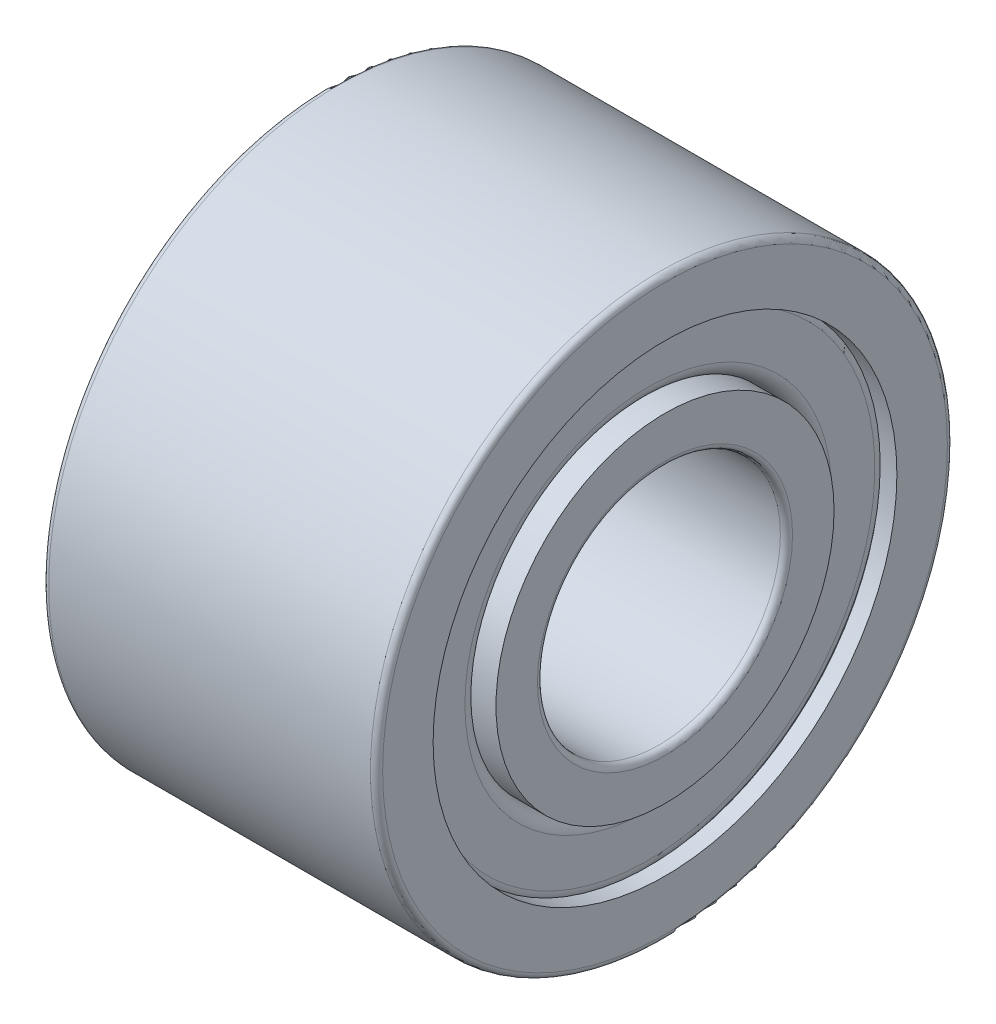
ISO-10303-21;
HEADER;
FILE_DESCRIPTION(('STEP AP214'),'2;1');
FILE_NAME('part.step','',(''),(''),'','','');
FILE_SCHEMA(('AUTOMOTIVE_DESIGN { 1 0 10303 214 1 1 1 1 }'));
ENDSEC;
DATA;
#1=APPLICATION_CONTEXT('core data for automotive mechanical design processes');
#2=APPLICATION_PROTOCOL_DEFINITION('international standard','automotive_design',2000,#1);
#3=PRODUCT_CONTEXT('',#1,'mechanical');
#4=PRODUCT('Part','Part','',(#3));
#5=PRODUCT_RELATED_PRODUCT_CATEGORY('part','',(#4));
#6=PRODUCT_DEFINITION_FORMATION('','',#4);
#7=PRODUCT_DEFINITION_CONTEXT('part definition',#1,'design');
#8=PRODUCT_DEFINITION('design','',#6,#7);
#9=PRODUCT_DEFINITION_SHAPE('','',#8);
#10=(LENGTH_UNIT() NAMED_UNIT(*) SI_UNIT(.MILLI.,.METRE.));
#11=(NAMED_UNIT(*) PLANE_ANGLE_UNIT() SI_UNIT($,.RADIAN.));
#12=(NAMED_UNIT(*) SI_UNIT($,.STERADIAN.) SOLID_ANGLE_UNIT());
#13=UNCERTAINTY_MEASURE_WITH_UNIT(LENGTH_MEASURE(1.E-05),#10,'distance_accuracy_value','');
#14=(GEOMETRIC_REPRESENTATION_CONTEXT(3) GLOBAL_UNCERTAINTY_ASSIGNED_CONTEXT((#13)) GLOBAL_UNIT_ASSIGNED_CONTEXT((#10,
#11,#12)) REPRESENTATION_CONTEXT('',''));
#15=CARTESIAN_POINT('',(0.,0.,0.));
#16=DIRECTION('',(0.,0.,1.));
#17=DIRECTION('',(1.,0.,0.));
#18=AXIS2_PLACEMENT_3D('',#15,#16,#17);
#19=CARTESIAN_POINT('',(-7.9375,0.,0.));
#20=DIRECTION('',(1.,0.,0.));
#21=DIRECTION('',(0.,0.,-1.));
#22=AXIS2_PLACEMENT_3D('',#19,#20,#21);
#23=CYLINDRICAL_SURFACE('',#22,7.9325);
#24=CARTESIAN_POINT('',(-4.95,0.,0.));
#25=DIRECTION('',(1.,0.,0.));
#26=DIRECTION('',(0.,0.,-1.));
#27=AXIS2_PLACEMENT_3D('',#24,#25,#26);
#28=CIRCLE('',#27,7.9325);
#29=CARTESIAN_POINT('',(-4.95,0.,-7.9325));
#30=VERTEX_POINT('',#29);
#31=EDGE_CURVE('E10',#30,#30,#28,.T.);
#32=ORIENTED_EDGE('',*,*,#31,.F.);
#33=EDGE_LOOP('',(#32));
#34=FACE_BOUND('',#33,.T.);
#35=CARTESIAN_POINT('',(-4.50754735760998,0.,0.));
#36=DIRECTION('',(1.,0.,0.));
#37=DIRECTION('',(0.,0.,-1.));
#38=AXIS2_PLACEMENT_3D('',#35,#36,#37);
#39=CIRCLE('',#38,7.9325);
#40=CARTESIAN_POINT('',(-4.50754735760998,0.,-7.9325));
#41=VERTEX_POINT('',#40);
#42=EDGE_CURVE('E40',#41,#41,#39,.T.);
#43=ORIENTED_EDGE('',*,*,#42,.T.);
#44=EDGE_LOOP('',(#43));
#45=FACE_BOUND('',#44,.T.);
#46=ADVANCED_FACE('F37',(#34,#45),#23,.F.);
#47=CARTESIAN_POINT('',(4.95,0.,0.));
#48=DIRECTION('',(1.,0.,0.));
#49=DIRECTION('',(0.,0.,-1.));
#50=AXIS2_PLACEMENT_3D('',#47,#48,#49);
#51=CIRCLE('',#50,7.9325);
#52=CARTESIAN_POINT('',(4.95,0.,-7.9325));
#53=VERTEX_POINT('',#52);
#54=EDGE_CURVE('E58',#53,#53,#51,.T.);
#55=ORIENTED_EDGE('',*,*,#54,.T.);
#56=EDGE_LOOP('',(#55));
#57=FACE_BOUND('',#56,.T.);
#58=CARTESIAN_POINT('',(4.50754735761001,0.,0.));
#59=DIRECTION('',(-1.,0.,0.));
#60=DIRECTION('',(0.,0.,1.));
#61=AXIS2_PLACEMENT_3D('',#58,#59,#60);
#62=CIRCLE('',#61,7.9325);
#63=CARTESIAN_POINT('',(4.50754735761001,0.,7.9325));
#64=VERTEX_POINT('',#63);
#65=EDGE_CURVE('E52',#64,#64,#62,.T.);
#66=ORIENTED_EDGE('',*,*,#65,.T.);
#67=EDGE_LOOP('',(#66));
#68=FACE_BOUND('',#67,.T.);
#69=ADVANCED_FACE('F105',(#57,#68),#23,.F.);
#70=CARTESIAN_POINT('',(-4.95,7.9325,0.));
#71=DIRECTION('',(1.,0.,0.));
#72=DIRECTION('',(0.,0.,-1.));
#73=AXIS2_PLACEMENT_3D('',#70,#71,#72);
#74=PLANE('',#73);
#75=ORIENTED_EDGE('',*,*,#31,.T.);
#76=EDGE_LOOP('',(#75));
#77=FACE_BOUND('',#76,.T.);
#78=CARTESIAN_POINT('',(-4.95,0.,0.));
#79=DIRECTION('',(1.,0.,0.));
#80=DIRECTION('',(0.,0.,-1.));
#81=AXIS2_PLACEMENT_3D('',#78,#79,#80);
#82=CIRCLE('',#81,7.636875);
#83=CARTESIAN_POINT('',(-4.95,0.,-7.636875));
#84=VERTEX_POINT('',#83);
#85=EDGE_CURVE('E44',#84,#84,#82,.T.);
#86=ORIENTED_EDGE('',*,*,#85,.F.);
#87=EDGE_LOOP('',(#86));
#88=FACE_BOUND('',#87,.T.);
#89=ADVANCED_FACE('F96',(#77,#88),#74,.T.);
#90=CARTESIAN_POINT('',(-7.9375,0.,0.));
#91=DIRECTION('',(1.,0.,0.));
#92=DIRECTION('',(0.,0.,-1.));
#93=AXIS2_PLACEMENT_3D('',#90,#91,#92);
#94=CYLINDRICAL_SURFACE('',#93,7.636875);
#95=ORIENTED_EDGE('',*,*,#85,.T.);
#96=EDGE_LOOP('',(#95));
#97=FACE_BOUND('',#96,.T.);
#98=CARTESIAN_POINT('',(-5.5,0.,0.));
#99=DIRECTION('',(1.,0.,0.));
#100=DIRECTION('',(0.,0.,-1.));
#101=AXIS2_PLACEMENT_3D('',#98,#99,#100);
#102=CIRCLE('',#101,7.636875);
#103=CARTESIAN_POINT('',(-5.5,0.,-7.636875));
#104=VERTEX_POINT('',#103);
#105=EDGE_CURVE('E49',#104,#104,#102,.T.);
#106=ORIENTED_EDGE('',*,*,#105,.F.);
#107=EDGE_LOOP('',(#106));
#108=FACE_BOUND('',#107,.T.);
#109=ADVANCED_FACE('F94',(#97,#108),#94,.F.);
#110=CARTESIAN_POINT('',(-5.5,7.636875,0.));
#111=DIRECTION('',(-1.,0.,0.));
#112=DIRECTION('',(0.,0.,1.));
#113=AXIS2_PLACEMENT_3D('',#110,#111,#112);
#114=PLANE('',#113);
#115=ORIENTED_EDGE('',*,*,#105,.T.);
#116=EDGE_LOOP('',(#115));
#117=FACE_BOUND('',#116,.T.);
#118=CARTESIAN_POINT('',(-5.5,0.,0.));
#119=DIRECTION('',(1.,0.,0.));
#120=DIRECTION('',(0.,0.,-1.));
#121=AXIS2_PLACEMENT_3D('',#118,#119,#120);
#122=CIRCLE('',#121,9.3);
#123=CARTESIAN_POINT('',(-5.5,0.,-9.3));
#124=VERTEX_POINT('',#123);
#125=EDGE_CURVE('E86',#124,#124,#122,.T.);
#126=ORIENTED_EDGE('',*,*,#125,.F.);
#127=EDGE_LOOP('',(#126));
#128=FACE_BOUND('',#127,.T.);
#129=ADVANCED_FACE('F91',(#117,#128),#114,.T.);
#130=CARTESIAN_POINT('',(-5.3,0.,0.));
#131=DIRECTION('',(1.,0.,0.));
#132=DIRECTION('',(0.,0.,-1.));
#133=AXIS2_PLACEMENT_3D('',#130,#131,#132);
#134=TOROIDAL_SURFACE('',#133,9.3,0.199999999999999);
#135=ORIENTED_EDGE('',*,*,#125,.T.);
#136=EDGE_LOOP('',(#135));
#137=FACE_BOUND('',#136,.T.);
#138=CARTESIAN_POINT('',(-5.3,0.,0.));
#139=DIRECTION('',(1.,0.,0.));
#140=DIRECTION('',(0.,0.,-1.));
#141=AXIS2_PLACEMENT_3D('',#138,#139,#140);
#142=CIRCLE('',#141,9.5);
#143=CARTESIAN_POINT('',(-5.3,0.,-9.5));
#144=VERTEX_POINT('',#143);
#145=EDGE_CURVE('E83',#144,#144,#142,.T.);
#146=ORIENTED_EDGE('',*,*,#145,.F.);
#147=EDGE_LOOP('',(#146));
#148=FACE_BOUND('',#147,.T.);
#149=ADVANCED_FACE('F103',(#137,#148),#134,.T.);
#150=CARTESIAN_POINT('',(-7.9375,0.,0.));
#151=DIRECTION('',(1.,0.,0.));
#152=DIRECTION('',(0.,0.,-1.));
#153=AXIS2_PLACEMENT_3D('',#150,#151,#152);
#154=CYLINDRICAL_SURFACE('',#153,9.5);
#155=ORIENTED_EDGE('',*,*,#145,.T.);
#156=EDGE_LOOP('',(#155));
#157=FACE_BOUND('',#156,.T.);
#158=CARTESIAN_POINT('',(5.3,0.,0.));
#159=DIRECTION('',(1.,0.,0.));
#160=DIRECTION('',(0.,0.,-1.));
#161=AXIS2_PLACEMENT_3D('',#158,#159,#160);
#162=CIRCLE('',#161,9.5);
#163=CARTESIAN_POINT('',(5.3,0.,-9.5));
#164=VERTEX_POINT('',#163);
#165=EDGE_CURVE('E80',#164,#164,#162,.T.);
#166=ORIENTED_EDGE('',*,*,#165,.F.);
#167=EDGE_LOOP('',(#166));
#168=FACE_BOUND('',#167,.T.);
#169=ADVANCED_FACE('F143',(#157,#168),#154,.T.);
#170=CARTESIAN_POINT('',(5.3,0.,0.));
#171=DIRECTION('',(1.,0.,0.));
#172=DIRECTION('',(0.,0.,-1.));
#173=AXIS2_PLACEMENT_3D('',#170,#171,#172);
#174=TOROIDAL_SURFACE('',#173,9.3,0.199999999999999);
#175=ORIENTED_EDGE('',*,*,#165,.T.);
#176=EDGE_LOOP('',(#175));
#177=FACE_BOUND('',#176,.T.);
#178=CARTESIAN_POINT('',(5.5,0.,0.));
#179=DIRECTION('',(1.,0.,0.));
#180=DIRECTION('',(0.,0.,-1.));
#181=AXIS2_PLACEMENT_3D('',#178,#179,#180);
#182=CIRCLE('',#181,9.3);
#183=CARTESIAN_POINT('',(5.5,0.,-9.3));
#184=VERTEX_POINT('',#183);
#185=EDGE_CURVE('E77',#184,#184,#182,.T.);
#186=ORIENTED_EDGE('',*,*,#185,.F.);
#187=EDGE_LOOP('',(#186));
#188=FACE_BOUND('',#187,.T.);
#189=ADVANCED_FACE('F139',(#177,#188),#174,.T.);
#190=CARTESIAN_POINT('',(5.5,9.3,0.));
#191=DIRECTION('',(1.,0.,0.));
#192=DIRECTION('',(0.,0.,-1.));
#193=AXIS2_PLACEMENT_3D('',#190,#191,#192);
#194=PLANE('',#193);
#195=ORIENTED_EDGE('',*,*,#185,.T.);
#196=EDGE_LOOP('',(#195));
#197=FACE_BOUND('',#196,.T.);
#198=CARTESIAN_POINT('',(5.5,0.,0.));
#199=DIRECTION('',(1.,0.,0.));
#200=DIRECTION('',(0.,0.,-1.));
#201=AXIS2_PLACEMENT_3D('',#198,#199,#200);
#202=CIRCLE('',#201,7.636875);
#203=CARTESIAN_POINT('',(5.5,0.,-7.636875));
#204=VERTEX_POINT('',#203);
#205=EDGE_CURVE('E74',#204,#204,#202,.T.);
#206=ORIENTED_EDGE('',*,*,#205,.F.);
#207=EDGE_LOOP('',(#206));
#208=FACE_BOUND('',#207,.T.);
#209=ADVANCED_FACE('F135',(#197,#208),#194,.T.);
#210=CARTESIAN_POINT('',(-7.9375,0.,0.));
#211=DIRECTION('',(1.,0.,0.));
#212=DIRECTION('',(0.,0.,-1.));
#213=AXIS2_PLACEMENT_3D('',#210,#211,#212);
#214=CYLINDRICAL_SURFACE('',#213,7.636875);
#215=ORIENTED_EDGE('',*,*,#205,.T.);
#216=EDGE_LOOP('',(#215));
#217=FACE_BOUND('',#216,.T.);
#218=CARTESIAN_POINT('',(4.95,0.,0.));
#219=DIRECTION('',(1.,0.,0.));
#220=DIRECTION('',(0.,0.,-1.));
#221=AXIS2_PLACEMENT_3D('',#218,#219,#220);
#222=CIRCLE('',#221,7.636875);
#223=CARTESIAN_POINT('',(4.95,0.,-7.636875));
#224=VERTEX_POINT('',#223);
#225=EDGE_CURVE('E71',#224,#224,#222,.T.);
#226=ORIENTED_EDGE('',*,*,#225,.F.);
#227=EDGE_LOOP('',(#226));
#228=FACE_BOUND('',#227,.T.);
#229=ADVANCED_FACE('F128',(#217,#228),#214,.F.);
#230=CARTESIAN_POINT('',(4.95,7.636875,0.));
#231=DIRECTION('',(-1.,0.,0.));
#232=DIRECTION('',(0.,0.,1.));
#233=AXIS2_PLACEMENT_3D('',#230,#231,#232);
#234=PLANE('',#233);
#235=ORIENTED_EDGE('',*,*,#225,.T.);
#236=EDGE_LOOP('',(#235));
#237=FACE_BOUND('',#236,.T.);
#238=ORIENTED_EDGE('',*,*,#54,.F.);
#239=EDGE_LOOP('',(#238));
#240=FACE_BOUND('',#239,.T.);
#241=ADVANCED_FACE('F120',(#237,#240),#234,.T.);
#242=CARTESIAN_POINT('',(-4.4768,0.,0.));
#243=DIRECTION('',(-1.,0.,0.));
#244=DIRECTION('',(0.,0.,1.));
#245=AXIS2_PLACEMENT_3D('',#242,#243,#244);
#246=TOROIDAL_SURFACE('',#245,7.4603,0.473200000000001);
#247=ORIENTED_EDGE('',*,*,#42,.F.);
#248=EDGE_LOOP('',(#247));
#249=FACE_BOUND('',#248,.T.);
#250=CARTESIAN_POINT('',(-4.95,0.,0.));
#251=DIRECTION('',(-1.,0.,0.));
#252=DIRECTION('',(0.,0.,1.));
#253=AXIS2_PLACEMENT_3D('',#250,#251,#252);
#254=CIRCLE('',#253,7.4603);
#255=CARTESIAN_POINT('',(-4.95,0.,7.4603));
#256=VERTEX_POINT('',#255);
#257=EDGE_CURVE('E54',#256,#256,#254,.T.);
#258=ORIENTED_EDGE('',*,*,#257,.F.);
#259=EDGE_LOOP('',(#258));
#260=FACE_BOUND('',#259,.T.);
#261=ADVANCED_FACE('F116',(#249,#260),#246,.T.);
#262=CARTESIAN_POINT('',(-4.95,7.4603,0.));
#263=DIRECTION('',(1.,0.,0.));
#264=DIRECTION('',(0.,0.,-1.));
#265=AXIS2_PLACEMENT_3D('',#262,#263,#264);
#266=PLANE('',#265);
#267=CARTESIAN_POINT('',(-4.95,0.,0.));
#268=DIRECTION('',(-1.,0.,0.));
#269=DIRECTION('',(0.,0.,1.));
#270=AXIS2_PLACEMENT_3D('',#267,#268,#269);
#271=CIRCLE('',#270,6.0407);
#272=CARTESIAN_POINT('',(-4.95,0.,6.0407));
#273=VERTEX_POINT('',#272);
#274=EDGE_CURVE('E60',#273,#273,#271,.T.);
#275=ORIENTED_EDGE('',*,*,#274,.F.);
#276=EDGE_LOOP('',(#275));
#277=FACE_BOUND('',#276,.T.);
#278=ORIENTED_EDGE('',*,*,#257,.T.);
#279=EDGE_LOOP('',(#278));
#280=FACE_BOUND('',#279,.T.);
#281=ADVANCED_FACE('F119',(#277,#280),#266,.F.);
#282=CARTESIAN_POINT('',(-4.4768,0.,0.));
#283=DIRECTION('',(-1.,0.,0.));
#284=DIRECTION('',(0.,0.,1.));
#285=AXIS2_PLACEMENT_3D('',#282,#283,#284);
#286=TOROIDAL_SURFACE('',#285,6.0407,0.4732);
#287=CARTESIAN_POINT('',(-4.4768,0.,0.));
#288=DIRECTION('',(-1.,0.,0.));
#289=DIRECTION('',(0.,0.,1.));
#290=AXIS2_PLACEMENT_3D('',#287,#288,#289);
#291=CIRCLE('',#290,5.5675);
#292=CARTESIAN_POINT('',(-4.4768,0.,5.5675));
#293=VERTEX_POINT('',#292);
#294=EDGE_CURVE('E65',#293,#293,#291,.T.);
#295=ORIENTED_EDGE('',*,*,#294,.F.);
#296=EDGE_LOOP('',(#295));
#297=FACE_BOUND('',#296,.T.);
#298=ORIENTED_EDGE('',*,*,#274,.T.);
#299=EDGE_LOOP('',(#298));
#300=FACE_BOUND('',#299,.T.);
#301=ADVANCED_FACE('F125',(#297,#300),#286,.T.);
#302=CARTESIAN_POINT('',(4.4768,0.,0.));
#303=DIRECTION('',(-1.,0.,0.));
#304=DIRECTION('',(0.,0.,1.));
#305=AXIS2_PLACEMENT_3D('',#302,#303,#304);
#306=TOROIDAL_SURFACE('',#305,6.0407,0.4732);
#307=CARTESIAN_POINT('',(4.95,0.,0.));
#308=DIRECTION('',(-1.,0.,0.));
#309=DIRECTION('',(0.,0.,1.));
#310=AXIS2_PLACEMENT_3D('',#307,#308,#309);
#311=CIRCLE('',#310,6.0407);
#312=CARTESIAN_POINT('',(4.95,0.,6.0407));
#313=VERTEX_POINT('',#312);
#314=EDGE_CURVE('E350',#313,#313,#311,.T.);
#315=ORIENTED_EDGE('',*,*,#314,.F.);
#316=EDGE_LOOP('',(#315));
#317=FACE_BOUND('',#316,.T.);
#318=CARTESIAN_POINT('',(4.4768,0.,0.));
#319=DIRECTION('',(1.,0.,0.));
#320=DIRECTION('',(0.,0.,-1.));
#321=AXIS2_PLACEMENT_3D('',#318,#319,#320);
#322=CIRCLE('',#321,5.5675);
#323=CARTESIAN_POINT('',(4.4768,0.,-5.5675));
#324=VERTEX_POINT('',#323);
#325=EDGE_CURVE('E344',#324,#324,#322,.T.);
#326=ORIENTED_EDGE('',*,*,#325,.F.);
#327=EDGE_LOOP('',(#326));
#328=FACE_BOUND('',#327,.T.);
#329=ADVANCED_FACE('F221',(#317,#328),#306,.T.);
#330=CARTESIAN_POINT('',(4.95,6.0407,0.));
#331=DIRECTION('',(-1.,0.,0.));
#332=DIRECTION('',(0.,0.,1.));
#333=AXIS2_PLACEMENT_3D('',#330,#331,#332);
#334=PLANE('',#333);
#335=CARTESIAN_POINT('',(4.95,0.,0.));
#336=DIRECTION('',(-1.,0.,0.));
#337=DIRECTION('',(0.,0.,1.));
#338=AXIS2_PLACEMENT_3D('',#335,#336,#337);
#339=CIRCLE('',#338,7.4603);
#340=CARTESIAN_POINT('',(4.95,0.,7.4603));
#341=VERTEX_POINT('',#340);
#342=EDGE_CURVE('E347',#341,#341,#339,.T.);
#343=ORIENTED_EDGE('',*,*,#342,.F.);
#344=EDGE_LOOP('',(#343));
#345=FACE_BOUND('',#344,.T.);
#346=ORIENTED_EDGE('',*,*,#314,.T.);
#347=EDGE_LOOP('',(#346));
#348=FACE_BOUND('',#347,.T.);
#349=ADVANCED_FACE('F230',(#345,#348),#334,.F.);
#350=CARTESIAN_POINT('',(4.4768,0.,0.));
#351=DIRECTION('',(-1.,0.,0.));
#352=DIRECTION('',(0.,0.,1.));
#353=AXIS2_PLACEMENT_3D('',#350,#351,#352);
#354=TOROIDAL_SURFACE('',#353,7.4603,0.473199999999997);
#355=ORIENTED_EDGE('',*,*,#65,.F.);
#356=EDGE_LOOP('',(#355));
#357=FACE_BOUND('',#356,.T.);
#358=ORIENTED_EDGE('',*,*,#342,.T.);
#359=EDGE_LOOP('',(#358));
#360=FACE_BOUND('',#359,.T.);
#361=ADVANCED_FACE('F240',(#357,#360),#354,.T.);
#362=CARTESIAN_POINT('',(-7.9375,0.,0.));
#363=DIRECTION('',(1.,0.,0.));
#364=DIRECTION('',(0.,0.,-1.));
#365=AXIS2_PLACEMENT_3D('',#362,#363,#364);
#366=CYLINDRICAL_SURFACE('',#365,5.5675);
#367=CARTESIAN_POINT('',(-5.5,0.,0.));
#368=DIRECTION('',(1.,0.,0.));
#369=DIRECTION('',(0.,0.,-1.));
#370=AXIS2_PLACEMENT_3D('',#367,#368,#369);
#371=CIRCLE('',#370,5.5675);
#372=CARTESIAN_POINT('',(-5.5,0.,-5.5675));
#373=VERTEX_POINT('',#372);
#374=EDGE_CURVE('E341',#373,#373,#371,.T.);
#375=ORIENTED_EDGE('',*,*,#374,.T.);
#376=EDGE_LOOP('',(#375));
#377=FACE_BOUND('',#376,.T.);
#378=ORIENTED_EDGE('',*,*,#294,.T.);
#379=EDGE_LOOP('',(#378));
#380=FACE_BOUND('',#379,.T.);
#381=ADVANCED_FACE('F250',(#377,#380),#366,.T.);
#382=ORIENTED_EDGE('',*,*,#325,.T.);
#383=EDGE_LOOP('',(#382));
#384=FACE_BOUND('',#383,.T.);
#385=CARTESIAN_POINT('',(5.5,0.,0.));
#386=DIRECTION('',(1.,0.,0.));
#387=DIRECTION('',(0.,0.,-1.));
#388=AXIS2_PLACEMENT_3D('',#385,#386,#387);
#389=CIRCLE('',#388,5.5675);
#390=CARTESIAN_POINT('',(5.5,0.,-5.5675));
#391=VERTEX_POINT('',#390);
#392=EDGE_CURVE('E325',#391,#391,#389,.T.);
#393=ORIENTED_EDGE('',*,*,#392,.F.);
#394=EDGE_LOOP('',(#393));
#395=FACE_BOUND('',#394,.T.);
#396=ADVANCED_FACE('F260',(#384,#395),#366,.T.);
#397=CARTESIAN_POINT('',(-5.5,5.5675,0.));
#398=DIRECTION('',(-1.,0.,0.));
#399=DIRECTION('',(0.,0.,1.));
#400=AXIS2_PLACEMENT_3D('',#397,#398,#399);
#401=PLANE('',#400);
#402=CARTESIAN_POINT('',(-5.5,0.,0.));
#403=DIRECTION('',(1.,0.,0.));
#404=DIRECTION('',(0.,0.,-1.));
#405=AXIS2_PLACEMENT_3D('',#402,#403,#404);
#406=CIRCLE('',#405,4.2);
#407=CARTESIAN_POINT('',(-5.5,0.,-4.2));
#408=VERTEX_POINT('',#407);
#409=EDGE_CURVE('E338',#408,#408,#406,.T.);
#410=ORIENTED_EDGE('',*,*,#409,.T.);
#411=EDGE_LOOP('',(#410));
#412=FACE_BOUND('',#411,.T.);
#413=ORIENTED_EDGE('',*,*,#374,.F.);
#414=EDGE_LOOP('',(#413));
#415=FACE_BOUND('',#414,.T.);
#416=ADVANCED_FACE('F270',(#412,#415),#401,.T.);
#417=CARTESIAN_POINT('',(-5.3,0.,0.));
#418=DIRECTION('',(1.,0.,0.));
#419=DIRECTION('',(0.,0.,-1.));
#420=AXIS2_PLACEMENT_3D('',#417,#418,#419);
#421=TOROIDAL_SURFACE('',#420,4.2,0.200000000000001);
#422=CARTESIAN_POINT('',(-5.3,0.,0.));
#423=DIRECTION('',(1.,0.,0.));
#424=DIRECTION('',(0.,0.,-1.));
#425=AXIS2_PLACEMENT_3D('',#422,#423,#424);
#426=CIRCLE('',#425,4.);
#427=CARTESIAN_POINT('',(-5.3,0.,-4.));
#428=VERTEX_POINT('',#427);
#429=EDGE_CURVE('E332',#428,#428,#426,.T.);
#430=ORIENTED_EDGE('',*,*,#429,.T.);
#431=EDGE_LOOP('',(#430));
#432=FACE_BOUND('',#431,.T.);
#433=ORIENTED_EDGE('',*,*,#409,.F.);
#434=EDGE_LOOP('',(#433));
#435=FACE_BOUND('',#434,.T.);
#436=ADVANCED_FACE('F279',(#432,#435),#421,.T.);
#437=CARTESIAN_POINT('',(-7.9375,0.,0.));
#438=DIRECTION('',(1.,0.,0.));
#439=DIRECTION('',(0.,0.,-1.));
#440=AXIS2_PLACEMENT_3D('',#437,#438,#439);
#441=CYLINDRICAL_SURFACE('',#440,4.);
#442=CARTESIAN_POINT('',(5.3,0.,0.));
#443=DIRECTION('',(1.,0.,0.));
#444=DIRECTION('',(0.,0.,-1.));
#445=AXIS2_PLACEMENT_3D('',#442,#443,#444);
#446=CIRCLE('',#445,4.);
#447=CARTESIAN_POINT('',(5.3,0.,-4.));
#448=VERTEX_POINT('',#447);
#449=EDGE_CURVE('E329',#448,#448,#446,.T.);
#450=ORIENTED_EDGE('',*,*,#449,.T.);
#451=EDGE_LOOP('',(#450));
#452=FACE_BOUND('',#451,.T.);
#453=ORIENTED_EDGE('',*,*,#429,.F.);
#454=EDGE_LOOP('',(#453));
#455=FACE_BOUND('',#454,.T.);
#456=ADVANCED_FACE('F289',(#452,#455),#441,.F.);
#457=CARTESIAN_POINT('',(5.3,0.,0.));
#458=DIRECTION('',(1.,0.,0.));
#459=DIRECTION('',(0.,0.,-1.));
#460=AXIS2_PLACEMENT_3D('',#457,#458,#459);
#461=TOROIDAL_SURFACE('',#460,4.2,0.2);
#462=CARTESIAN_POINT('',(5.5,0.,0.));
#463=DIRECTION('',(1.,0.,0.));
#464=DIRECTION('',(0.,0.,-1.));
#465=AXIS2_PLACEMENT_3D('',#462,#463,#464);
#466=CIRCLE('',#465,4.2);
#467=CARTESIAN_POINT('',(5.5,0.,-4.2));
#468=VERTEX_POINT('',#467);
#469=EDGE_CURVE('E328',#468,#468,#466,.T.);
#470=ORIENTED_EDGE('',*,*,#469,.T.);
#471=EDGE_LOOP('',(#470));
#472=FACE_BOUND('',#471,.T.);
#473=ORIENTED_EDGE('',*,*,#449,.F.);
#474=EDGE_LOOP('',(#473));
#475=FACE_BOUND('',#474,.T.);
#476=ADVANCED_FACE('F299',(#472,#475),#461,.T.);
#477=CARTESIAN_POINT('',(5.5,4.2,0.));
#478=DIRECTION('',(1.,0.,0.));
#479=DIRECTION('',(0.,0.,-1.));
#480=AXIS2_PLACEMENT_3D('',#477,#478,#479);
#481=PLANE('',#480);
#482=ORIENTED_EDGE('',*,*,#392,.T.);
#483=EDGE_LOOP('',(#482));
#484=FACE_BOUND('',#483,.T.);
#485=ORIENTED_EDGE('',*,*,#469,.F.);
#486=EDGE_LOOP('',(#485));
#487=FACE_BOUND('',#486,.T.);
#488=ADVANCED_FACE('F309',(#484,#487),#481,.T.);
#489=CLOSED_SHELL('',(#46,#69,#89,#109,#129,#149,#169,#189,#209,#229,#241,#261,#281,#301,#329,
#349,#361,#381,#396,#416,#436,#456,#476,#488));
#490=MANIFOLD_SOLID_BREP('B2',#489);
#491=ADVANCED_BREP_SHAPE_REPRESENTATION('',(#18,#490),#14);
#492=SHAPE_DEFINITION_REPRESENTATION(#9,#491);
ENDSEC;
END-ISO-10303-21;
